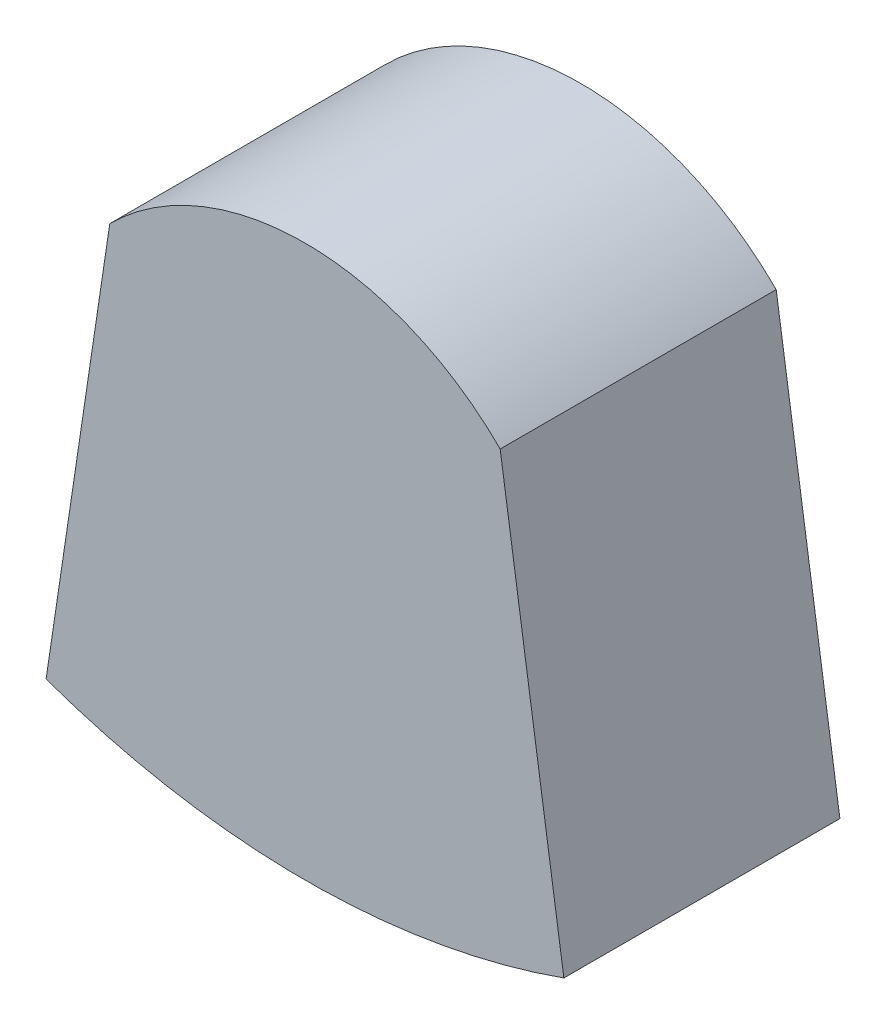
from build123d import *

# Parameters (mm, degrees)
BOSS_EXTRUDE_KNOB_DEPTH = 2.54


with BuildPart() as part:
    # Sketch Knob → Boss-Extrude Knob (new body)
    with BuildSketch(Plane.XY):
        with BuildLine():
            Line((-1.796051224, -0.11938), (-2.382165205, -4.041812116))
            ThreePointArc((-2.382165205, -4.041812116), (0, -4.452630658), (2.382165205, -4.041812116))
            Line((2.382165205, -4.041812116), (1.796051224, -0.11938))
            ThreePointArc((1.796051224, -0.11938), (0, 0.624568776), (-1.796051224, -0.11938))
        make_face()
    extrude(amount=BOSS_EXTRUDE_KNOB_DEPTH)


solid = part.part
